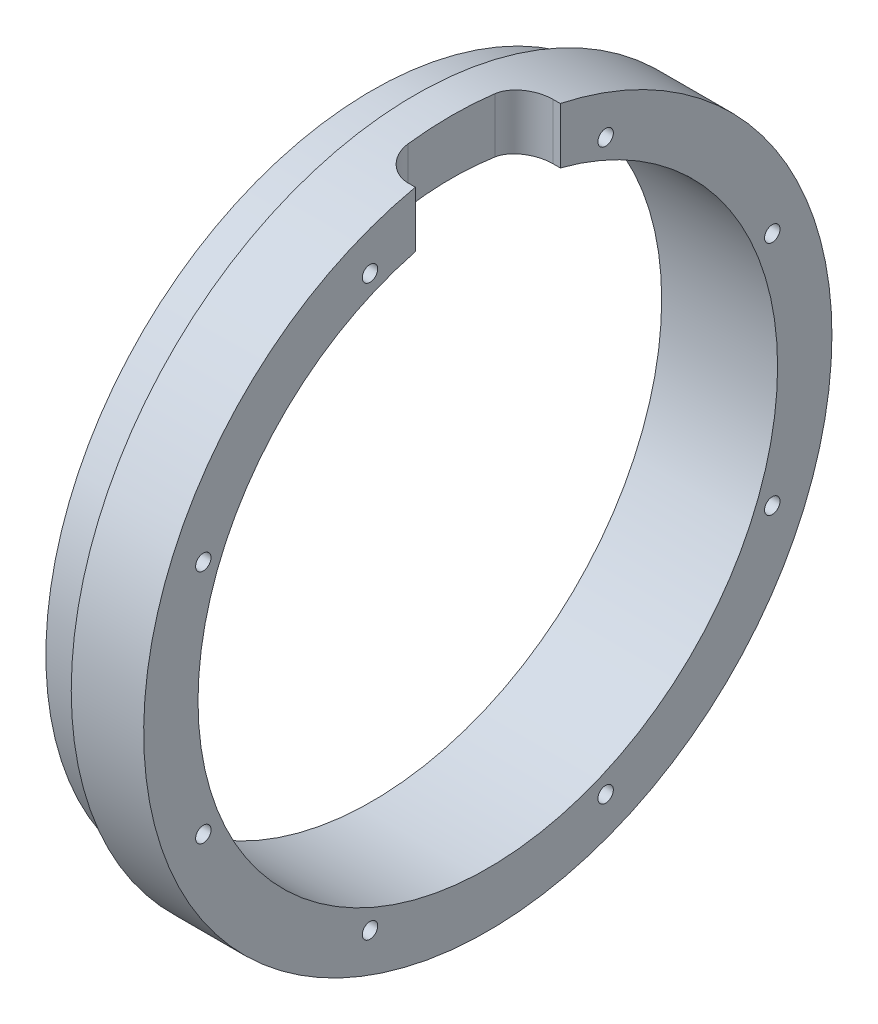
ISO-10303-21;
HEADER;
FILE_DESCRIPTION(('STEP AP214'),'2;1');
FILE_NAME('part.step','',(''),(''),'','','');
FILE_SCHEMA(('AUTOMOTIVE_DESIGN { 1 0 10303 214 1 1 1 1 }'));
ENDSEC;
DATA;
#1=APPLICATION_CONTEXT('core data for automotive mechanical design processes');
#2=APPLICATION_PROTOCOL_DEFINITION('international standard','automotive_design',2000,#1);
#3=PRODUCT_CONTEXT('',#1,'mechanical');
#4=PRODUCT('Part','Part','',(#3));
#5=PRODUCT_RELATED_PRODUCT_CATEGORY('part','',(#4));
#6=PRODUCT_DEFINITION_FORMATION('','',#4);
#7=PRODUCT_DEFINITION_CONTEXT('part definition',#1,'design');
#8=PRODUCT_DEFINITION('design','',#6,#7);
#9=PRODUCT_DEFINITION_SHAPE('','',#8);
#10=(LENGTH_UNIT() NAMED_UNIT(*) SI_UNIT(.MILLI.,.METRE.));
#11=(NAMED_UNIT(*) PLANE_ANGLE_UNIT() SI_UNIT($,.RADIAN.));
#12=(NAMED_UNIT(*) SI_UNIT($,.STERADIAN.) SOLID_ANGLE_UNIT());
#13=UNCERTAINTY_MEASURE_WITH_UNIT(LENGTH_MEASURE(1.E-05),#10,'distance_accuracy_value','');
#14=(GEOMETRIC_REPRESENTATION_CONTEXT(3) GLOBAL_UNCERTAINTY_ASSIGNED_CONTEXT((#13)) GLOBAL_UNIT_ASSIGNED_CONTEXT((#10,
#11,#12)) REPRESENTATION_CONTEXT('',''));
#15=CARTESIAN_POINT('',(0.,0.,0.));
#16=DIRECTION('',(0.,0.,1.));
#17=DIRECTION('',(1.,0.,0.));
#18=AXIS2_PLACEMENT_3D('',#15,#16,#17);
#19=CARTESIAN_POINT('',(0.,0.,0.));
#20=DIRECTION('',(1.,0.,0.));
#21=DIRECTION('',(0.,0.,-1.));
#22=AXIS2_PLACEMENT_3D('',#19,#20,#21);
#23=CYLINDRICAL_SURFACE('',#22,60.325);
#24=CARTESIAN_POINT('',(0.,0.,0.));
#25=DIRECTION('',(1.,0.,0.));
#26=DIRECTION('',(0.,0.,-1.));
#27=AXIS2_PLACEMENT_3D('',#24,#25,#26);
#28=CIRCLE('',#27,60.325);
#29=CARTESIAN_POINT('',(0.,0.,-60.325));
#30=VERTEX_POINT('',#29);
#31=EDGE_CURVE('E121',#30,#30,#28,.T.);
#32=ORIENTED_EDGE('',*,*,#31,.T.);
#33=EDGE_LOOP('',(#32));
#34=FACE_BOUND('',#33,.T.);
#35=DIRECTION('',(1.,0.,0.));
#36=VECTOR('',#35,1.);
#37=CARTESIAN_POINT('',(0.,58.9730075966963,-12.7));
#38=LINE('',#37,#36);
#39=CARTESIAN_POINT('',(12.7,58.9730075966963,-12.7));
#40=VERTEX_POINT('',#39);
#41=CARTESIAN_POINT('',(11.43,58.9730075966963,-12.7));
#42=VERTEX_POINT('',#41);
#43=EDGE_CURVE('E120',#40,#42,#38,.F.);
#44=ORIENTED_EDGE('',*,*,#43,.F.);
#45=CARTESIAN_POINT('',(12.7,0.,0.));
#46=DIRECTION('',(1.,0.,0.));
#47=DIRECTION('',(0.,0.,-1.));
#48=AXIS2_PLACEMENT_3D('',#45,#46,#47);
#49=CIRCLE('',#48,60.325);
#50=CARTESIAN_POINT('',(12.7,58.9730075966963,12.7));
#51=VERTEX_POINT('',#50);
#52=EDGE_CURVE('E116',#51,#40,#49,.T.);
#53=ORIENTED_EDGE('',*,*,#52,.F.);
#54=DIRECTION('',(1.,0.,0.));
#55=VECTOR('',#54,1.);
#56=CARTESIAN_POINT('',(0.,58.9730075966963,12.7));
#57=LINE('',#56,#55);
#58=CARTESIAN_POINT('',(11.43,58.9730075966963,12.7));
#59=VERTEX_POINT('',#58);
#60=EDGE_CURVE('E98',#59,#51,#57,.T.);
#61=ORIENTED_EDGE('',*,*,#60,.F.);
#62=CARTESIAN_POINT('',(11.43,58.9730075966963,12.7));
#63=CARTESIAN_POINT('',(11.2891734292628,58.9730000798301,12.7000170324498));
#64=CARTESIAN_POINT('',(11.1483507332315,58.9742684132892,12.6941447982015));
#65=CARTESIAN_POINT('',(10.8677367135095,58.9793021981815,12.6707458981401));
#66=CARTESIAN_POINT('',(10.7279452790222,58.9830673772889,12.6532205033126));
#67=CARTESIAN_POINT('',(10.4505960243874,58.993032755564,12.6066745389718));
#68=CARTESIAN_POINT('',(10.3130351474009,58.9992292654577,12.5776713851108));
#69=CARTESIAN_POINT('',(10.0409061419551,59.0139528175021,12.5084075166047));
#70=CARTESIAN_POINT('',(9.90633801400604,59.0224798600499,12.4681468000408));
#71=CARTESIAN_POINT('',(9.64113785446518,59.0417266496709,12.3766844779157));
#72=CARTESIAN_POINT('',(9.51050576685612,59.0524463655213,12.3254830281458));
#73=CARTESIAN_POINT('',(9.25402599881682,59.075912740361,12.212513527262));
#74=CARTESIAN_POINT('',(9.12818010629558,59.0886601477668,12.1507415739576));
#75=CARTESIAN_POINT('',(8.88221312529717,59.115977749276,12.0171313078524));
#76=CARTESIAN_POINT('',(8.76209018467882,59.1305473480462,11.9452962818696));
#77=CARTESIAN_POINT('',(8.52827677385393,59.1613001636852,11.7920437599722));
#78=CARTESIAN_POINT('',(8.41458872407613,59.1774839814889,11.7106226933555));
#79=CARTESIAN_POINT('',(8.19316970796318,59.2114202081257,11.5378152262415));
#80=CARTESIAN_POINT('',(8.08552196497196,59.2291884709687,11.4463252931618));
#81=CARTESIAN_POINT('',(7.87828233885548,59.2658845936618,11.2547795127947));
#82=CARTESIAN_POINT('',(7.77869346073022,59.2848128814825,11.1547204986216));
#83=CARTESIAN_POINT('',(7.5882690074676,59.3235629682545,10.9467653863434));
#84=CARTESIAN_POINT('',(7.49743238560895,59.3433846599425,10.8388702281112));
#85=CARTESIAN_POINT('',(7.32507349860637,59.3836643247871,10.6159739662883));
#86=CARTESIAN_POINT('',(7.24355460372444,59.4041225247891,10.5009703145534));
#87=CARTESIAN_POINT('',(7.01099817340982,59.4668239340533,10.1420862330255));
#88=CARTESIAN_POINT('',(6.87538049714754,59.509689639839,9.88806437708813));
#89=CARTESIAN_POINT('',(6.64900327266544,59.5948842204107,9.36090925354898));
#90=CARTESIAN_POINT('',(6.55822040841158,59.6372133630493,9.08778600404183));
#91=CARTESIAN_POINT('',(6.44428677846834,59.7070704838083,8.61452161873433));
#92=CARTESIAN_POINT('',(6.40898126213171,59.7351996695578,8.41731946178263));
#93=CARTESIAN_POINT('',(6.36183298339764,59.7898275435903,8.0201489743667));
#94=CARTESIAN_POINT('',(6.34996278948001,59.8163281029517,7.82018415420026));
#95=CARTESIAN_POINT('',(6.35,59.8418016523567,7.61999999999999));
#96=B_SPLINE_CURVE_WITH_KNOTS('',3,(#62,#63,#64,#65,#66,#67,#68,#69,#70,#71,#72,#73,#74,#75,#76,
#77,#78,#79,#80,#81,#82,#83,#84,#85,#86,#87,#88,#89,#90,#91,#92,#93,#94,#95),.UNSPECIFIED.,.F.,
.F.,(4,2,2,2,2,2,2,2,2,2,2,2,2,2,2,2,4),(0.,0.422345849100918,0.844645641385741,1.2663071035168,
1.6879686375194,2.10962416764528,2.53143569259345,2.95310976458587,3.37494140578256,
3.80160843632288,4.22843383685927,4.65520812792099,5.0821362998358,5.95113544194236,
6.81968218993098,7.42527168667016,8.0301519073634),.UNSPECIFIED.);
#97=CARTESIAN_POINT('',(6.35,59.8418016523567,7.61999999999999));
#98=VERTEX_POINT('',#97);
#99=EDGE_CURVE('E154',#59,#98,#96,.T.);
#100=ORIENTED_EDGE('',*,*,#99,.T.);
#101=CARTESIAN_POINT('',(6.35,0.,0.));
#102=DIRECTION('',(1.,0.,0.));
#103=DIRECTION('',(0.,0.,-1.));
#104=AXIS2_PLACEMENT_3D('',#101,#102,#103);
#105=CIRCLE('',#104,60.325);
#106=CARTESIAN_POINT('',(6.35,59.8418016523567,-7.62));
#107=VERTEX_POINT('',#106);
#108=EDGE_CURVE('E108',#107,#98,#105,.T.);
#109=ORIENTED_EDGE('',*,*,#108,.F.);
#110=CARTESIAN_POINT('',(6.35,59.8418016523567,-7.62));
#111=CARTESIAN_POINT('',(6.34998514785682,59.8234138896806,-7.76444577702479));
#112=CARTESIAN_POINT('',(6.35616010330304,59.8044934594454,-7.90881842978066));
#113=CARTESIAN_POINT('',(6.38074630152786,59.7657576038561,-8.19638447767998));
#114=CARTESIAN_POINT('',(6.39915643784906,59.7459422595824,-8.33957797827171));
#115=CARTESIAN_POINT('',(6.44804931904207,59.7056003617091,-8.62366067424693));
#116=CARTESIAN_POINT('',(6.47852198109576,59.6850744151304,-8.76455169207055));
#117=CARTESIAN_POINT('',(6.55129824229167,59.6434961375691,-9.0431643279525));
#118=CARTESIAN_POINT('',(6.59360185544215,59.6224438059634,-9.18088594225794));
#119=CARTESIAN_POINT('',(6.68973440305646,59.5800317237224,-9.4522116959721));
#120=CARTESIAN_POINT('',(6.74356440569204,59.5586719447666,-9.58581545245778));
#121=CARTESIAN_POINT('',(6.86238712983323,59.5158797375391,-9.84801179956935));
#122=CARTESIAN_POINT('',(6.92738395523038,59.4944472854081,-9.97660252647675));
#123=CARTESIAN_POINT('',(7.06804579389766,59.4517835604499,-10.2277699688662));
#124=CARTESIAN_POINT('',(7.14370612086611,59.4305522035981,-10.3503492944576));
#125=CARTESIAN_POINT('',(7.3052290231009,59.3885420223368,-10.5887372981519));
#126=CARTESIAN_POINT('',(7.39109512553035,59.3677633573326,-10.7045436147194));
#127=CARTESIAN_POINT('',(7.57265149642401,59.3268917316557,-10.9287953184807));
#128=CARTESIAN_POINT('',(7.66836545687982,59.3068005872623,-11.0372218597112));
#129=CARTESIAN_POINT('',(7.86878948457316,59.2676389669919,-11.2456142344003));
#130=CARTESIAN_POINT('',(7.97349945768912,59.2485684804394,-11.3455801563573));
#131=CARTESIAN_POINT('',(8.19123798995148,59.2117197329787,-11.5363475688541));
#132=CARTESIAN_POINT('',(8.30426944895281,59.1939419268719,-11.6271458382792));
#133=CARTESIAN_POINT('',(8.53779170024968,59.15996250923,-11.7988184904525));
#134=CARTESIAN_POINT('',(8.65827968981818,59.1437603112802,-11.879696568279));
#135=CARTESIAN_POINT('',(8.90470769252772,59.1133279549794,-12.0302088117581));
#136=CARTESIAN_POINT('',(9.03058381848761,59.0990802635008,-12.0999440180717));
#137=CARTESIAN_POINT('',(9.28791923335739,59.0726072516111,-12.2285325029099));
#138=CARTESIAN_POINT('',(9.41937630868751,59.0603811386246,-12.2873900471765));
#139=CARTESIAN_POINT('',(9.68691407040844,59.0381517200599,-12.3937573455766));
#140=CARTESIAN_POINT('',(9.82299237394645,59.0281472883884,-12.4412728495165));
#141=CARTESIAN_POINT('',(10.0987805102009,59.0105250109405,-12.5245906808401));
#142=CARTESIAN_POINT('',(10.2384892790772,59.0029064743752,-12.5603963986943));
#143=CARTESIAN_POINT('',(10.5520859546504,58.9887640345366,-12.6266686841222));
#144=CARTESIAN_POINT('',(10.72664645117,58.9828633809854,-12.6541626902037));
#145=CARTESIAN_POINT('',(10.9897903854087,58.9769548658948,-12.6816597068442));
#146=CARTESIAN_POINT('',(11.077681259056,58.9754757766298,-12.6885347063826));
#147=CARTESIAN_POINT('',(11.2537083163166,58.9735019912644,-12.6977045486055));
#148=CARTESIAN_POINT('',(11.3418444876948,58.9730072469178,-12.6999996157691));
#149=CARTESIAN_POINT('',(11.43,58.9730075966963,-12.7));
#150=B_SPLINE_CURVE_WITH_KNOTS('',3,(#110,#111,#112,#113,#114,#115,#116,#117,#118,#119,#120,
#121,#122,#123,#124,#125,#126,#127,#128,#129,#130,#131,#132,#133,#134,#135,#136,#137,#138,#139,
#140,#141,#142,#143,#144,#145,#146,#147,#148,#149),.UNSPECIFIED.,.F.,.F.,(4,2,2,2,2,2,2,2,2,2,2,
2,2,2,2,2,2,2,2,4),(0.,0.436694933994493,0.873350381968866,1.30964160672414,1.74593334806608,
2.18226553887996,2.61875842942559,3.055060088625,3.49151297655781,3.92904158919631,
4.36656562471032,4.80424285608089,5.24175656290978,5.67504516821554,6.10816349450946,
6.54106178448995,6.97383462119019,7.50314318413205,7.7675528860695,8.03194962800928),.UNSPECIFIED.);
#151=EDGE_CURVE('E13',#107,#42,#150,.T.);
#152=ORIENTED_EDGE('',*,*,#151,.T.);
#153=EDGE_LOOP('',(#44,#53,#61,#100,#109,#152));
#154=FACE_BOUND('',#153,.T.);
#155=ADVANCED_FACE('F41',(#34,#154),#23,.T.);
#156=CARTESIAN_POINT('',(12.7,0.,60.325));
#157=DIRECTION('',(-1.,0.,0.));
#158=DIRECTION('',(0.,0.,1.));
#159=AXIS2_PLACEMENT_3D('',#156,#157,#158);
#160=PLANE('',#159);
#161=CARTESIAN_POINT('',(12.7,49.8663977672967,20.6553382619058));
#162=DIRECTION('',(-1.,0.,0.));
#163=DIRECTION('',(0.,0.,1.));
#164=AXIS2_PLACEMENT_3D('',#161,#162,#163);
#165=CIRCLE('',#164,1.35254999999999);
#166=CARTESIAN_POINT('',(12.7,49.8663977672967,22.0078882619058));
#167=VERTEX_POINT('',#166);
#168=EDGE_CURVE('E244',#167,#167,#165,.T.);
#169=ORIENTED_EDGE('',*,*,#168,.T.);
#170=EDGE_LOOP('',(#169));
#171=FACE_BOUND('',#170,.T.);
#172=CARTESIAN_POINT('',(12.7,20.6553382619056,49.8663977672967));
#173=DIRECTION('',(-1.,0.,0.));
#174=DIRECTION('',(0.,0.,1.));
#175=AXIS2_PLACEMENT_3D('',#172,#173,#174);
#176=CIRCLE('',#175,1.35254999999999);
#177=CARTESIAN_POINT('',(12.7,20.6553382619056,51.2189477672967));
#178=VERTEX_POINT('',#177);
#179=EDGE_CURVE('E252',#178,#178,#176,.T.);
#180=ORIENTED_EDGE('',*,*,#179,.T.);
#181=EDGE_LOOP('',(#180));
#182=FACE_BOUND('',#181,.T.);
#183=CARTESIAN_POINT('',(12.7,-20.6553382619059,49.8663977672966));
#184=DIRECTION('',(-1.,0.,0.));
#185=DIRECTION('',(0.,0.,1.));
#186=AXIS2_PLACEMENT_3D('',#183,#184,#185);
#187=CIRCLE('',#186,1.35254999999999);
#188=CARTESIAN_POINT('',(12.7,-20.6553382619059,51.2189477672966));
#189=VERTEX_POINT('',#188);
#190=EDGE_CURVE('E258',#189,#189,#187,.T.);
#191=ORIENTED_EDGE('',*,*,#190,.T.);
#192=EDGE_LOOP('',(#191));
#193=FACE_BOUND('',#192,.T.);
#194=CARTESIAN_POINT('',(12.7,-49.8663977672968,20.6553382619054));
#195=DIRECTION('',(-1.,0.,0.));
#196=DIRECTION('',(0.,0.,1.));
#197=AXIS2_PLACEMENT_3D('',#194,#195,#196);
#198=CIRCLE('',#197,1.35254999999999);
#199=CARTESIAN_POINT('',(12.7,-49.8663977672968,22.0078882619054));
#200=VERTEX_POINT('',#199);
#201=EDGE_CURVE('E264',#200,#200,#198,.T.);
#202=ORIENTED_EDGE('',*,*,#201,.T.);
#203=EDGE_LOOP('',(#202));
#204=FACE_BOUND('',#203,.T.);
#205=CARTESIAN_POINT('',(12.7,-49.8663977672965,-20.6553382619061));
#206=DIRECTION('',(-1.,0.,0.));
#207=DIRECTION('',(0.,0.,1.));
#208=AXIS2_PLACEMENT_3D('',#205,#206,#207);
#209=CIRCLE('',#208,1.35254999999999);
#210=CARTESIAN_POINT('',(12.7,-49.8663977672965,-19.3027882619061));
#211=VERTEX_POINT('',#210);
#212=EDGE_CURVE('E270',#211,#211,#209,.T.);
#213=ORIENTED_EDGE('',*,*,#212,.T.);
#214=EDGE_LOOP('',(#213));
#215=FACE_BOUND('',#214,.T.);
#216=CARTESIAN_POINT('',(12.7,-20.6553382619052,-49.8663977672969));
#217=DIRECTION('',(-1.,0.,0.));
#218=DIRECTION('',(0.,0.,1.));
#219=AXIS2_PLACEMENT_3D('',#216,#217,#218);
#220=CIRCLE('',#219,1.35254999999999);
#221=CARTESIAN_POINT('',(12.7,-20.6553382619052,-48.5138477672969));
#222=VERTEX_POINT('',#221);
#223=EDGE_CURVE('E276',#222,#222,#220,.T.);
#224=ORIENTED_EDGE('',*,*,#223,.T.);
#225=EDGE_LOOP('',(#224));
#226=FACE_BOUND('',#225,.T.);
#227=CARTESIAN_POINT('',(12.7,20.6553382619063,-49.8663977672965));
#228=DIRECTION('',(-1.,0.,0.));
#229=DIRECTION('',(0.,0.,1.));
#230=AXIS2_PLACEMENT_3D('',#227,#228,#229);
#231=CIRCLE('',#230,1.35254999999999);
#232=CARTESIAN_POINT('',(12.7,20.6553382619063,-48.5138477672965));
#233=VERTEX_POINT('',#232);
#234=EDGE_CURVE('E282',#233,#233,#231,.T.);
#235=ORIENTED_EDGE('',*,*,#234,.T.);
#236=EDGE_LOOP('',(#235));
#237=FACE_BOUND('',#236,.T.);
#238=CARTESIAN_POINT('',(12.7,49.866397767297,-20.6553382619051));
#239=DIRECTION('',(-1.,0.,0.));
#240=DIRECTION('',(0.,0.,1.));
#241=AXIS2_PLACEMENT_3D('',#238,#239,#240);
#242=CIRCLE('',#241,1.35254999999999);
#243=CARTESIAN_POINT('',(12.7,49.866397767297,-19.3027882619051));
#244=VERTEX_POINT('',#243);
#245=EDGE_CURVE('E288',#244,#244,#242,.T.);
#246=ORIENTED_EDGE('',*,*,#245,.T.);
#247=EDGE_LOOP('',(#246));
#248=FACE_BOUND('',#247,.T.);
#249=DIRECTION('',(0.,-1.,0.));
#250=VECTOR('',#249,1.);
#251=CARTESIAN_POINT('',(12.7,60.325,-12.7));
#252=LINE('',#251,#250);
#253=CARTESIAN_POINT('',(12.7,49.1868884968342,-12.7));
#254=VERTEX_POINT('',#253);
#255=EDGE_CURVE('E109',#40,#254,#252,.T.);
#256=ORIENTED_EDGE('',*,*,#255,.T.);
#257=CARTESIAN_POINT('',(12.7,0.,0.));
#258=DIRECTION('',(1.,0.,0.));
#259=DIRECTION('',(0.,0.,-1.));
#260=AXIS2_PLACEMENT_3D('',#257,#258,#259);
#261=CIRCLE('',#260,50.8);
#262=CARTESIAN_POINT('',(12.7,49.1868884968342,12.7));
#263=VERTEX_POINT('',#262);
#264=EDGE_CURVE('E118',#263,#254,#261,.T.);
#265=ORIENTED_EDGE('',*,*,#264,.F.);
#266=DIRECTION('',(0.,-1.,0.));
#267=VECTOR('',#266,1.);
#268=CARTESIAN_POINT('',(12.7,60.325,12.7));
#269=LINE('',#268,#267);
#270=EDGE_CURVE('E102',#51,#263,#269,.T.);
#271=ORIENTED_EDGE('',*,*,#270,.F.);
#272=ORIENTED_EDGE('',*,*,#52,.T.);
#273=EDGE_LOOP('',(#256,#265,#271,#272));
#274=FACE_BOUND('',#273,.T.);
#275=ADVANCED_FACE('F115',(#171,#182,#193,#204,#215,#226,#237,#248,#274),#160,.F.);
#276=CARTESIAN_POINT('',(0.,0.,0.));
#277=DIRECTION('',(1.,0.,0.));
#278=DIRECTION('',(0.,0.,-1.));
#279=AXIS2_PLACEMENT_3D('',#276,#277,#278);
#280=CYLINDRICAL_SURFACE('',#279,50.8);
#281=CARTESIAN_POINT('',(-7.62,0.,0.));
#282=DIRECTION('',(1.,0.,0.));
#283=DIRECTION('',(0.,0.,-1.));
#284=AXIS2_PLACEMENT_3D('',#281,#282,#283);
#285=CIRCLE('',#284,50.8);
#286=CARTESIAN_POINT('',(-7.62,0.,-50.8));
#287=VERTEX_POINT('',#286);
#288=EDGE_CURVE('E126',#287,#287,#285,.T.);
#289=ORIENTED_EDGE('',*,*,#288,.F.);
#290=EDGE_LOOP('',(#289));
#291=FACE_BOUND('',#290,.T.);
#292=DIRECTION('',(1.,0.,0.));
#293=VECTOR('',#292,1.);
#294=CARTESIAN_POINT('',(0.,49.1868884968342,-12.7));
#295=LINE('',#294,#293);
#296=CARTESIAN_POINT('',(11.43,49.1868884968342,-12.7));
#297=VERTEX_POINT('',#296);
#298=EDGE_CURVE('E137',#297,#254,#295,.T.);
#299=ORIENTED_EDGE('',*,*,#298,.F.);
#300=CARTESIAN_POINT('',(11.43,49.1868884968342,-12.7));
#301=CARTESIAN_POINT('',(11.2900252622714,49.1868793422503,-12.7000177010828));
#302=CARTESIAN_POINT('',(11.1500551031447,49.1883819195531,-12.6942154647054));
#303=CARTESIAN_POINT('',(10.8711501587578,49.1943439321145,-12.6711005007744));
#304=CARTESIAN_POINT('',(10.7322152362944,49.1988029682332,-12.6537893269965));
#305=CARTESIAN_POINT('',(10.4566194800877,49.2106005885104,-12.6078276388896));
#306=CARTESIAN_POINT('',(10.3199549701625,49.2179339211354,-12.5791978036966));
#307=CARTESIAN_POINT('',(10.0496093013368,49.2353534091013,-12.5108443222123));
#308=CARTESIAN_POINT('',(9.91592815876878,49.2454395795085,-12.471120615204));
#309=CARTESIAN_POINT('',(9.65249871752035,49.2681967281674,-12.3809107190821));
#310=CARTESIAN_POINT('',(9.52274984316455,49.2808673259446,-12.3304261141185));
#311=CARTESIAN_POINT('',(9.26799646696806,49.3085950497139,-12.219073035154));
#312=CARTESIAN_POINT('',(9.1429937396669,49.3236530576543,-12.1582007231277));
#313=CARTESIAN_POINT('',(8.89863745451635,49.3559135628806,-12.0265699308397));
#314=CARTESIAN_POINT('',(8.77928256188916,49.3731155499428,-11.9558138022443));
#315=CARTESIAN_POINT('',(8.54691331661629,49.4094150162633,-11.8049028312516));
#316=CARTESIAN_POINT('',(8.4339013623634,49.4285132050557,-11.7247444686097));
#317=CARTESIAN_POINT('',(8.21318672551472,49.4686491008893,-11.5542436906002));
#318=CARTESIAN_POINT('',(8.10560069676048,49.4897133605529,-11.4637564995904));
#319=CARTESIAN_POINT('',(7.89840334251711,49.5332162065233,-11.2743045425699));
#320=CARTESIAN_POINT('',(7.79879498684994,49.5556552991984,-11.175336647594));
#321=CARTESIAN_POINT('',(7.6082234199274,49.6015942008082,-10.9696373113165));
#322=CARTESIAN_POINT('',(7.51725933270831,49.6250939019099,-10.8629066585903));
#323=CARTESIAN_POINT('',(7.34451647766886,49.6728516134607,-10.6423953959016));
#324=CARTESIAN_POINT('',(7.26274105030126,49.6971098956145,-10.5286122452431));
#325=CARTESIAN_POINT('',(7.0279642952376,49.7718561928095,-10.1716370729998));
#326=CARTESIAN_POINT('',(6.89045976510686,49.8231095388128,-9.91814966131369));
#327=CARTESIAN_POINT('',(6.66029824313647,49.925023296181,-9.3916922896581));
#328=CARTESIAN_POINT('',(6.56761915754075,49.9756839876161,-9.11873200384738));
#329=CARTESIAN_POINT('',(6.44935888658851,50.0601650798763,-8.64064529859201));
#330=CARTESIAN_POINT('',(6.41216897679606,50.0946583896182,-8.43844234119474));
#331=CARTESIAN_POINT('',(6.36248196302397,50.1616135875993,-8.03092097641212));
#332=CARTESIAN_POINT('',(6.34995875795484,50.1940775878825,-7.82560609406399));
#333=CARTESIAN_POINT('',(6.35,50.2252486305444,-7.62));
#334=B_SPLINE_CURVE_WITH_KNOTS('',3,(#300,#301,#302,#303,#304,#305,#306,#307,#308,#309,#310,
#311,#312,#313,#314,#315,#316,#317,#318,#319,#320,#321,#322,#323,#324,#325,#326,#327,#328,#329,
#330,#331,#332,#333),.UNSPECIFIED.,.F.,.F.,(4,2,2,2,2,2,2,2,2,2,2,2,2,2,2,2,4),(0.,
0.419789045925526,0.839521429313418,1.25849048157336,1.67746182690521,2.09637153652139,
2.51543636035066,2.93440164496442,3.35352429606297,3.77948268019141,4.20559890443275,
4.63167190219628,5.05789929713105,5.93220174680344,6.8060728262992,7.43004757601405,
8.05336171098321),.UNSPECIFIED.);
#335=CARTESIAN_POINT('',(6.35,50.2252486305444,-7.62));
#336=VERTEX_POINT('',#335);
#337=EDGE_CURVE('E54',#297,#336,#334,.T.);
#338=ORIENTED_EDGE('',*,*,#337,.T.);
#339=CARTESIAN_POINT('',(6.35,0.,0.));
#340=DIRECTION('',(1.,0.,0.));
#341=DIRECTION('',(0.,0.,-1.));
#342=AXIS2_PLACEMENT_3D('',#339,#340,#341);
#343=CIRCLE('',#342,50.8);
#344=CARTESIAN_POINT('',(6.35,50.2252486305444,7.61999999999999));
#345=VERTEX_POINT('',#344);
#346=EDGE_CURVE('E134',#345,#336,#343,.F.);
#347=ORIENTED_EDGE('',*,*,#346,.F.);
#348=CARTESIAN_POINT('',(6.35,50.2252486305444,7.61999999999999));
#349=CARTESIAN_POINT('',(6.34998537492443,50.2032409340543,7.76510062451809));
#350=CARTESIAN_POINT('',(6.35621606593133,50.1805930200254,7.91009744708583));
#351=CARTESIAN_POINT('',(6.38101056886,50.1342214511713,8.19884409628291));
#352=CARTESIAN_POINT('',(6.39957304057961,50.1104979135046,8.34259405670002));
#353=CARTESIAN_POINT('',(6.44885212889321,50.0621960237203,8.62771500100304));
#354=CARTESIAN_POINT('',(6.4795581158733,50.0376184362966,8.76908795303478));
#355=CARTESIAN_POINT('',(6.55287202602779,49.9878284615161,9.0485991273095));
#356=CARTESIAN_POINT('',(6.59548003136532,49.9626160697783,9.1867373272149));
#357=CARTESIAN_POINT('',(6.69228089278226,49.9118205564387,9.45882269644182));
#358=CARTESIAN_POINT('',(6.7464737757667,49.8862374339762,9.59276985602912));
#359=CARTESIAN_POINT('',(6.86608176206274,49.8349786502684,9.8555992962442));
#360=CARTESIAN_POINT('',(6.93150099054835,49.8093029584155,9.98447969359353));
#361=CARTESIAN_POINT('',(7.07307212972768,49.7581854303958,10.2361843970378));
#362=CARTESIAN_POINT('',(7.14921979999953,49.7327435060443,10.3590110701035));
#363=CARTESIAN_POINT('',(7.31178612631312,49.6823960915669,10.5978498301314));
#364=CARTESIAN_POINT('',(7.39820832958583,49.6574907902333,10.7138595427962));
#365=CARTESIAN_POINT('',(7.58106758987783,49.6084675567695,10.9386117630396));
#366=CARTESIAN_POINT('',(7.67754037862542,49.5843528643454,11.0473259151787));
#367=CARTESIAN_POINT('',(7.87959131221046,49.5373487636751,11.2562223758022));
#368=CARTESIAN_POINT('',(7.98516931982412,49.5144593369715,11.3564048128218));
#369=CARTESIAN_POINT('',(8.20475940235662,49.4702375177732,11.5475203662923));
#370=CARTESIAN_POINT('',(8.31877434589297,49.4489056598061,11.6384503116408));
#371=CARTESIAN_POINT('',(8.55438065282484,49.4081474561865,11.8102820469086));
#372=CARTESIAN_POINT('',(8.67596907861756,49.3887203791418,11.8911876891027));
#373=CARTESIAN_POINT('',(8.92416283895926,49.3523343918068,12.0413028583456));
#374=CARTESIAN_POINT('',(9.05067445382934,49.3353448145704,12.1106598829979));
#375=CARTESIAN_POINT('',(9.30933397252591,49.3038025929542,12.2384386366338));
#376=CARTESIAN_POINT('',(9.44147956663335,49.2892489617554,12.2968647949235));
#377=CARTESIAN_POINT('',(9.71042350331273,49.2628272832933,12.4022904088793));
#378=CARTESIAN_POINT('',(9.84721897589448,49.2509576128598,12.4492967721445));
#379=CARTESIAN_POINT('',(10.1244737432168,49.2301034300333,12.531508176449));
#380=CARTESIAN_POINT('',(10.2649318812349,49.221118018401,12.5667168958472));
#381=CARTESIAN_POINT('',(10.5748754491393,49.2048081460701,12.6304479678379));
#382=CARTESIAN_POINT('',(10.7449050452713,49.1981025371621,12.656512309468));
#383=CARTESIAN_POINT('',(11.0866265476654,49.1891347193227,12.6912991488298));
#384=CARTESIAN_POINT('',(11.2583160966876,49.1868669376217,12.7000433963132));
#385=CARTESIAN_POINT('',(11.43,49.1868884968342,12.7));
#386=B_SPLINE_CURVE_WITH_KNOTS('',3,(#348,#349,#350,#351,#352,#353,#354,#355,#356,#357,#358,
#359,#360,#361,#362,#363,#364,#365,#366,#367,#368,#369,#370,#371,#372,#373,#374,#375,#376,#377,
#378,#379,#380,#381,#382,#383,#384,#385),.UNSPECIFIED.,.F.,.F.,(4,2,2,2,2,2,2,2,2,2,2,2,2,2,2,2,
2,2,4),(0.,0.440137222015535,0.880226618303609,1.31993163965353,1.75963969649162,
2.1993487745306,2.63921977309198,3.0789173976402,3.51876726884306,3.96023801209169,
4.40170210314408,4.84331699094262,5.28476163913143,5.72004433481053,6.15515026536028,
6.58999235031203,7.02469873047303,7.54017842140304,8.0550103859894),.UNSPECIFIED.);
#387=CARTESIAN_POINT('',(11.43,49.1868884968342,12.7));
#388=VERTEX_POINT('',#387);
#389=EDGE_CURVE('E147',#345,#388,#386,.T.);
#390=ORIENTED_EDGE('',*,*,#389,.T.);
#391=DIRECTION('',(1.,0.,0.));
#392=VECTOR('',#391,1.);
#393=CARTESIAN_POINT('',(0.,49.1868884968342,12.7));
#394=LINE('',#393,#392);
#395=EDGE_CURVE('E132',#263,#388,#394,.F.);
#396=ORIENTED_EDGE('',*,*,#395,.F.);
#397=ORIENTED_EDGE('',*,*,#264,.T.);
#398=EDGE_LOOP('',(#299,#338,#347,#390,#396,#397));
#399=FACE_BOUND('',#398,.T.);
#400=ADVANCED_FACE('F158',(#291,#399),#280,.F.);
#401=CARTESIAN_POINT('',(0.,0.,0.));
#402=DIRECTION('',(1.,0.,0.));
#403=DIRECTION('',(0.,0.,-1.));
#404=AXIS2_PLACEMENT_3D('',#401,#402,#403);
#405=CYLINDRICAL_SURFACE('',#404,57.15);
#406=CARTESIAN_POINT('',(0.,0.,0.));
#407=DIRECTION('',(1.,0.,0.));
#408=DIRECTION('',(0.,0.,-1.));
#409=AXIS2_PLACEMENT_3D('',#406,#407,#408);
#410=CIRCLE('',#409,57.15);
#411=CARTESIAN_POINT('',(0.,0.,-57.15));
#412=VERTEX_POINT('',#411);
#413=EDGE_CURVE('E124',#412,#412,#410,.T.);
#414=ORIENTED_EDGE('',*,*,#413,.F.);
#415=EDGE_LOOP('',(#414));
#416=FACE_BOUND('',#415,.T.);
#417=CARTESIAN_POINT('',(-7.62,0.,0.));
#418=DIRECTION('',(1.,0.,0.));
#419=DIRECTION('',(0.,0.,-1.));
#420=AXIS2_PLACEMENT_3D('',#417,#418,#419);
#421=CIRCLE('',#420,57.15);
#422=CARTESIAN_POINT('',(-7.62,0.,-57.15));
#423=VERTEX_POINT('',#422);
#424=EDGE_CURVE('E238',#423,#423,#421,.T.);
#425=ORIENTED_EDGE('',*,*,#424,.T.);
#426=EDGE_LOOP('',(#425));
#427=FACE_BOUND('',#426,.T.);
#428=ADVANCED_FACE('F43',(#416,#427),#405,.T.);
#429=CARTESIAN_POINT('',(0.,0.,57.15));
#430=DIRECTION('',(1.,0.,0.));
#431=DIRECTION('',(0.,0.,-1.));
#432=AXIS2_PLACEMENT_3D('',#429,#430,#431);
#433=PLANE('',#432);
#434=ORIENTED_EDGE('',*,*,#31,.F.);
#435=EDGE_LOOP('',(#434));
#436=FACE_BOUND('',#435,.T.);
#437=ORIENTED_EDGE('',*,*,#413,.T.);
#438=EDGE_LOOP('',(#437));
#439=FACE_BOUND('',#438,.T.);
#440=ADVANCED_FACE('F213',(#436,#439),#433,.F.);
#441=CARTESIAN_POINT('',(-7.62,0.,50.8));
#442=DIRECTION('',(1.,0.,0.));
#443=DIRECTION('',(0.,0.,-1.));
#444=AXIS2_PLACEMENT_3D('',#441,#442,#443);
#445=PLANE('',#444);
#446=CARTESIAN_POINT('',(-7.62,49.866397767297,-20.6553382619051));
#447=DIRECTION('',(-1.,0.,0.));
#448=DIRECTION('',(0.,0.,1.));
#449=AXIS2_PLACEMENT_3D('',#446,#447,#448);
#450=CIRCLE('',#449,1.35254999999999);
#451=CARTESIAN_POINT('',(-7.62,49.866397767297,-19.3027882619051));
#452=VERTEX_POINT('',#451);
#453=EDGE_CURVE('E285',#452,#452,#450,.T.);
#454=ORIENTED_EDGE('',*,*,#453,.F.);
#455=EDGE_LOOP('',(#454));
#456=FACE_BOUND('',#455,.T.);
#457=CARTESIAN_POINT('',(-7.62,20.6553382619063,-49.8663977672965));
#458=DIRECTION('',(-1.,0.,0.));
#459=DIRECTION('',(0.,0.,1.));
#460=AXIS2_PLACEMENT_3D('',#457,#458,#459);
#461=CIRCLE('',#460,1.35254999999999);
#462=CARTESIAN_POINT('',(-7.62,20.6553382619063,-48.5138477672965));
#463=VERTEX_POINT('',#462);
#464=EDGE_CURVE('E279',#463,#463,#461,.T.);
#465=ORIENTED_EDGE('',*,*,#464,.F.);
#466=EDGE_LOOP('',(#465));
#467=FACE_BOUND('',#466,.T.);
#468=CARTESIAN_POINT('',(-7.62,-20.6553382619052,-49.8663977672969));
#469=DIRECTION('',(-1.,0.,0.));
#470=DIRECTION('',(0.,0.,1.));
#471=AXIS2_PLACEMENT_3D('',#468,#469,#470);
#472=CIRCLE('',#471,1.35254999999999);
#473=CARTESIAN_POINT('',(-7.62,-20.6553382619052,-48.5138477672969));
#474=VERTEX_POINT('',#473);
#475=EDGE_CURVE('E273',#474,#474,#472,.T.);
#476=ORIENTED_EDGE('',*,*,#475,.F.);
#477=EDGE_LOOP('',(#476));
#478=FACE_BOUND('',#477,.T.);
#479=CARTESIAN_POINT('',(-7.62,-49.8663977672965,-20.6553382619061));
#480=DIRECTION('',(-1.,0.,0.));
#481=DIRECTION('',(0.,0.,1.));
#482=AXIS2_PLACEMENT_3D('',#479,#480,#481);
#483=CIRCLE('',#482,1.35254999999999);
#484=CARTESIAN_POINT('',(-7.62,-49.8663977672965,-19.3027882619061));
#485=VERTEX_POINT('',#484);
#486=EDGE_CURVE('E267',#485,#485,#483,.T.);
#487=ORIENTED_EDGE('',*,*,#486,.F.);
#488=EDGE_LOOP('',(#487));
#489=FACE_BOUND('',#488,.T.);
#490=CARTESIAN_POINT('',(-7.62,-49.8663977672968,20.6553382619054));
#491=DIRECTION('',(-1.,0.,0.));
#492=DIRECTION('',(0.,0.,1.));
#493=AXIS2_PLACEMENT_3D('',#490,#491,#492);
#494=CIRCLE('',#493,1.35254999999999);
#495=CARTESIAN_POINT('',(-7.62,-49.8663977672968,22.0078882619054));
#496=VERTEX_POINT('',#495);
#497=EDGE_CURVE('E261',#496,#496,#494,.T.);
#498=ORIENTED_EDGE('',*,*,#497,.F.);
#499=EDGE_LOOP('',(#498));
#500=FACE_BOUND('',#499,.T.);
#501=CARTESIAN_POINT('',(-7.62,-20.6553382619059,49.8663977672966));
#502=DIRECTION('',(-1.,0.,0.));
#503=DIRECTION('',(0.,0.,1.));
#504=AXIS2_PLACEMENT_3D('',#501,#502,#503);
#505=CIRCLE('',#504,1.35254999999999);
#506=CARTESIAN_POINT('',(-7.62,-20.6553382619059,51.2189477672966));
#507=VERTEX_POINT('',#506);
#508=EDGE_CURVE('E255',#507,#507,#505,.T.);
#509=ORIENTED_EDGE('',*,*,#508,.F.);
#510=EDGE_LOOP('',(#509));
#511=FACE_BOUND('',#510,.T.);
#512=CARTESIAN_POINT('',(-7.62,20.6553382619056,49.8663977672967));
#513=DIRECTION('',(-1.,0.,0.));
#514=DIRECTION('',(0.,0.,1.));
#515=AXIS2_PLACEMENT_3D('',#512,#513,#514);
#516=CIRCLE('',#515,1.35254999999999);
#517=CARTESIAN_POINT('',(-7.62,20.6553382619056,51.2189477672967));
#518=VERTEX_POINT('',#517);
#519=EDGE_CURVE('E249',#518,#518,#516,.T.);
#520=ORIENTED_EDGE('',*,*,#519,.F.);
#521=EDGE_LOOP('',(#520));
#522=FACE_BOUND('',#521,.T.);
#523=CARTESIAN_POINT('',(-7.62,49.8663977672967,20.6553382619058));
#524=DIRECTION('',(-1.,0.,0.));
#525=DIRECTION('',(0.,0.,1.));
#526=AXIS2_PLACEMENT_3D('',#523,#524,#525);
#527=CIRCLE('',#526,1.35254999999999);
#528=CARTESIAN_POINT('',(-7.62,49.8663977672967,22.0078882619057));
#529=VERTEX_POINT('',#528);
#530=EDGE_CURVE('E240',#529,#529,#527,.T.);
#531=ORIENTED_EDGE('',*,*,#530,.F.);
#532=EDGE_LOOP('',(#531));
#533=FACE_BOUND('',#532,.T.);
#534=ORIENTED_EDGE('',*,*,#424,.F.);
#535=EDGE_LOOP('',(#534));
#536=FACE_BOUND('',#535,.T.);
#537=ORIENTED_EDGE('',*,*,#288,.T.);
#538=EDGE_LOOP('',(#537));
#539=FACE_BOUND('',#538,.T.);
#540=ADVANCED_FACE('F210',(#456,#467,#478,#489,#500,#511,#522,#533,#536,#539),#445,.F.);
#541=CARTESIAN_POINT('',(-7.62,49.8663977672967,20.6553382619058));
#542=DIRECTION('',(-1.,0.,0.));
#543=DIRECTION('',(0.,0.,1.));
#544=AXIS2_PLACEMENT_3D('',#541,#542,#543);
#545=CYLINDRICAL_SURFACE('',#544,1.35254999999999);
#546=ORIENTED_EDGE('',*,*,#168,.F.);
#547=EDGE_LOOP('',(#546));
#548=FACE_BOUND('',#547,.T.);
#549=ORIENTED_EDGE('',*,*,#530,.T.);
#550=EDGE_LOOP('',(#549));
#551=FACE_BOUND('',#550,.T.);
#552=ADVANCED_FACE('F207',(#548,#551),#545,.F.);
#553=CARTESIAN_POINT('',(-7.62,20.6553382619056,49.8663977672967));
#554=DIRECTION('',(-1.,0.,0.));
#555=DIRECTION('',(0.,0.,1.));
#556=AXIS2_PLACEMENT_3D('',#553,#554,#555);
#557=CYLINDRICAL_SURFACE('',#556,1.35254999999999);
#558=ORIENTED_EDGE('',*,*,#179,.F.);
#559=EDGE_LOOP('',(#558));
#560=FACE_BOUND('',#559,.T.);
#561=ORIENTED_EDGE('',*,*,#519,.T.);
#562=EDGE_LOOP('',(#561));
#563=FACE_BOUND('',#562,.T.);
#564=ADVANCED_FACE('F203',(#560,#563),#557,.F.);
#565=CARTESIAN_POINT('',(-7.62,-20.6553382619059,49.8663977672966));
#566=DIRECTION('',(-1.,0.,0.));
#567=DIRECTION('',(0.,0.,1.));
#568=AXIS2_PLACEMENT_3D('',#565,#566,#567);
#569=CYLINDRICAL_SURFACE('',#568,1.35254999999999);
#570=ORIENTED_EDGE('',*,*,#190,.F.);
#571=EDGE_LOOP('',(#570));
#572=FACE_BOUND('',#571,.T.);
#573=ORIENTED_EDGE('',*,*,#508,.T.);
#574=EDGE_LOOP('',(#573));
#575=FACE_BOUND('',#574,.T.);
#576=ADVANCED_FACE('F199',(#572,#575),#569,.F.);
#577=CARTESIAN_POINT('',(-7.62,-49.8663977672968,20.6553382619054));
#578=DIRECTION('',(-1.,0.,0.));
#579=DIRECTION('',(0.,0.,1.));
#580=AXIS2_PLACEMENT_3D('',#577,#578,#579);
#581=CYLINDRICAL_SURFACE('',#580,1.35254999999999);
#582=ORIENTED_EDGE('',*,*,#201,.F.);
#583=EDGE_LOOP('',(#582));
#584=FACE_BOUND('',#583,.T.);
#585=ORIENTED_EDGE('',*,*,#497,.T.);
#586=EDGE_LOOP('',(#585));
#587=FACE_BOUND('',#586,.T.);
#588=ADVANCED_FACE('F195',(#584,#587),#581,.F.);
#589=CARTESIAN_POINT('',(-7.62,-49.8663977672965,-20.6553382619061));
#590=DIRECTION('',(-1.,0.,0.));
#591=DIRECTION('',(0.,0.,1.));
#592=AXIS2_PLACEMENT_3D('',#589,#590,#591);
#593=CYLINDRICAL_SURFACE('',#592,1.35254999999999);
#594=ORIENTED_EDGE('',*,*,#212,.F.);
#595=EDGE_LOOP('',(#594));
#596=FACE_BOUND('',#595,.T.);
#597=ORIENTED_EDGE('',*,*,#486,.T.);
#598=EDGE_LOOP('',(#597));
#599=FACE_BOUND('',#598,.T.);
#600=ADVANCED_FACE('F191',(#596,#599),#593,.F.);
#601=CARTESIAN_POINT('',(-7.62,-20.6553382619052,-49.8663977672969));
#602=DIRECTION('',(-1.,0.,0.));
#603=DIRECTION('',(0.,0.,1.));
#604=AXIS2_PLACEMENT_3D('',#601,#602,#603);
#605=CYLINDRICAL_SURFACE('',#604,1.35254999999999);
#606=ORIENTED_EDGE('',*,*,#223,.F.);
#607=EDGE_LOOP('',(#606));
#608=FACE_BOUND('',#607,.T.);
#609=ORIENTED_EDGE('',*,*,#475,.T.);
#610=EDGE_LOOP('',(#609));
#611=FACE_BOUND('',#610,.T.);
#612=ADVANCED_FACE('F187',(#608,#611),#605,.F.);
#613=CARTESIAN_POINT('',(-7.62,20.6553382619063,-49.8663977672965));
#614=DIRECTION('',(-1.,0.,0.));
#615=DIRECTION('',(0.,0.,1.));
#616=AXIS2_PLACEMENT_3D('',#613,#614,#615);
#617=CYLINDRICAL_SURFACE('',#616,1.35254999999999);
#618=ORIENTED_EDGE('',*,*,#234,.F.);
#619=EDGE_LOOP('',(#618));
#620=FACE_BOUND('',#619,.T.);
#621=ORIENTED_EDGE('',*,*,#464,.T.);
#622=EDGE_LOOP('',(#621));
#623=FACE_BOUND('',#622,.T.);
#624=ADVANCED_FACE('F183',(#620,#623),#617,.F.);
#625=CARTESIAN_POINT('',(-7.62,49.866397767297,-20.6553382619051));
#626=DIRECTION('',(-1.,0.,0.));
#627=DIRECTION('',(0.,0.,1.));
#628=AXIS2_PLACEMENT_3D('',#625,#626,#627);
#629=CYLINDRICAL_SURFACE('',#628,1.35254999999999);
#630=ORIENTED_EDGE('',*,*,#245,.F.);
#631=EDGE_LOOP('',(#630));
#632=FACE_BOUND('',#631,.T.);
#633=ORIENTED_EDGE('',*,*,#453,.T.);
#634=EDGE_LOOP('',(#633));
#635=FACE_BOUND('',#634,.T.);
#636=ADVANCED_FACE('F179',(#632,#635),#629,.F.);
#637=CARTESIAN_POINT('',(12.7,60.325,-12.7));
#638=DIRECTION('',(0.,0.,1.));
#639=DIRECTION('',(1.,0.,0.));
#640=AXIS2_PLACEMENT_3D('',#637,#638,#639);
#641=PLANE('',#640);
#642=ORIENTED_EDGE('',*,*,#43,.T.);
#643=DIRECTION('',(0.,-1.,0.));
#644=VECTOR('',#643,1.);
#645=CARTESIAN_POINT('',(11.43,49.1868884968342,-12.7));
#646=LINE('',#645,#644);
#647=EDGE_CURVE('E145',#42,#297,#646,.T.);
#648=ORIENTED_EDGE('',*,*,#647,.T.);
#649=ORIENTED_EDGE('',*,*,#298,.T.);
#650=ORIENTED_EDGE('',*,*,#255,.F.);
#651=EDGE_LOOP('',(#642,#648,#649,#650));
#652=FACE_BOUND('',#651,.T.);
#653=ADVANCED_FACE('F175',(#652),#641,.T.);
#654=CARTESIAN_POINT('',(6.35,60.325,-12.7));
#655=DIRECTION('',(1.,0.,0.));
#656=DIRECTION('',(0.,0.,-1.));
#657=AXIS2_PLACEMENT_3D('',#654,#655,#656);
#658=PLANE('',#657);
#659=ORIENTED_EDGE('',*,*,#108,.T.);
#660=DIRECTION('',(0.,-1.,0.));
#661=VECTOR('',#660,1.);
#662=CARTESIAN_POINT('',(6.35,49.1868884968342,7.61999999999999));
#663=LINE('',#662,#661);
#664=EDGE_CURVE('E141',#98,#345,#663,.T.);
#665=ORIENTED_EDGE('',*,*,#664,.T.);
#666=ORIENTED_EDGE('',*,*,#346,.T.);
#667=DIRECTION('',(0.,-1.,0.));
#668=VECTOR('',#667,1.);
#669=CARTESIAN_POINT('',(6.35,58.9730075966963,-7.62));
#670=LINE('',#669,#668);
#671=EDGE_CURVE('E139',#336,#107,#670,.F.);
#672=ORIENTED_EDGE('',*,*,#671,.T.);
#673=EDGE_LOOP('',(#659,#665,#666,#672));
#674=FACE_BOUND('',#673,.T.);
#675=ADVANCED_FACE('F172',(#674),#658,.T.);
#676=CARTESIAN_POINT('',(12.7,60.325,12.7));
#677=DIRECTION('',(0.,0.,-1.));
#678=DIRECTION('',(-1.,0.,0.));
#679=AXIS2_PLACEMENT_3D('',#676,#677,#678);
#680=PLANE('',#679);
#681=ORIENTED_EDGE('',*,*,#395,.T.);
#682=DIRECTION('',(0.,-1.,0.));
#683=VECTOR('',#682,1.);
#684=CARTESIAN_POINT('',(11.43,58.9730075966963,12.7));
#685=LINE('',#684,#683);
#686=EDGE_CURVE('E105',#388,#59,#685,.F.);
#687=ORIENTED_EDGE('',*,*,#686,.T.);
#688=ORIENTED_EDGE('',*,*,#60,.T.);
#689=ORIENTED_EDGE('',*,*,#270,.T.);
#690=EDGE_LOOP('',(#681,#687,#688,#689));
#691=FACE_BOUND('',#690,.T.);
#692=ADVANCED_FACE('F101',(#691),#680,.T.);
#693=CARTESIAN_POINT('',(11.43,60.325,7.61999999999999));
#694=DIRECTION('',(0.,1.,0.));
#695=DIRECTION('',(0.,0.,1.));
#696=AXIS2_PLACEMENT_3D('',#693,#694,#695);
#697=CYLINDRICAL_SURFACE('',#696,5.08);
#698=ORIENTED_EDGE('',*,*,#99,.F.);
#699=ORIENTED_EDGE('',*,*,#686,.F.);
#700=ORIENTED_EDGE('',*,*,#389,.F.);
#701=ORIENTED_EDGE('',*,*,#664,.F.);
#702=EDGE_LOOP('',(#698,#699,#700,#701));
#703=FACE_BOUND('',#702,.T.);
#704=ADVANCED_FACE('F162',(#703),#697,.F.);
#705=CARTESIAN_POINT('',(11.43,60.325,-7.62));
#706=DIRECTION('',(0.,1.,0.));
#707=DIRECTION('',(0.,0.,1.));
#708=AXIS2_PLACEMENT_3D('',#705,#706,#707);
#709=CYLINDRICAL_SURFACE('',#708,5.08);
#710=ORIENTED_EDGE('',*,*,#151,.F.);
#711=ORIENTED_EDGE('',*,*,#671,.F.);
#712=ORIENTED_EDGE('',*,*,#337,.F.);
#713=ORIENTED_EDGE('',*,*,#647,.F.);
#714=EDGE_LOOP('',(#710,#711,#712,#713));
#715=FACE_BOUND('',#714,.T.);
#716=ADVANCED_FACE('F166',(#715),#709,.F.);
#717=CLOSED_SHELL('',(#155,#275,#400,#428,#440,#540,#552,#564,#576,#588,#600,#612,#624,#636,
#653,#675,#692,#704,#716));
#718=MANIFOLD_SOLID_BREP('B2',#717);
#719=ADVANCED_BREP_SHAPE_REPRESENTATION('',(#18,#718),#14);
#720=SHAPE_DEFINITION_REPRESENTATION(#9,#719);
ENDSEC;
END-ISO-10303-21;
